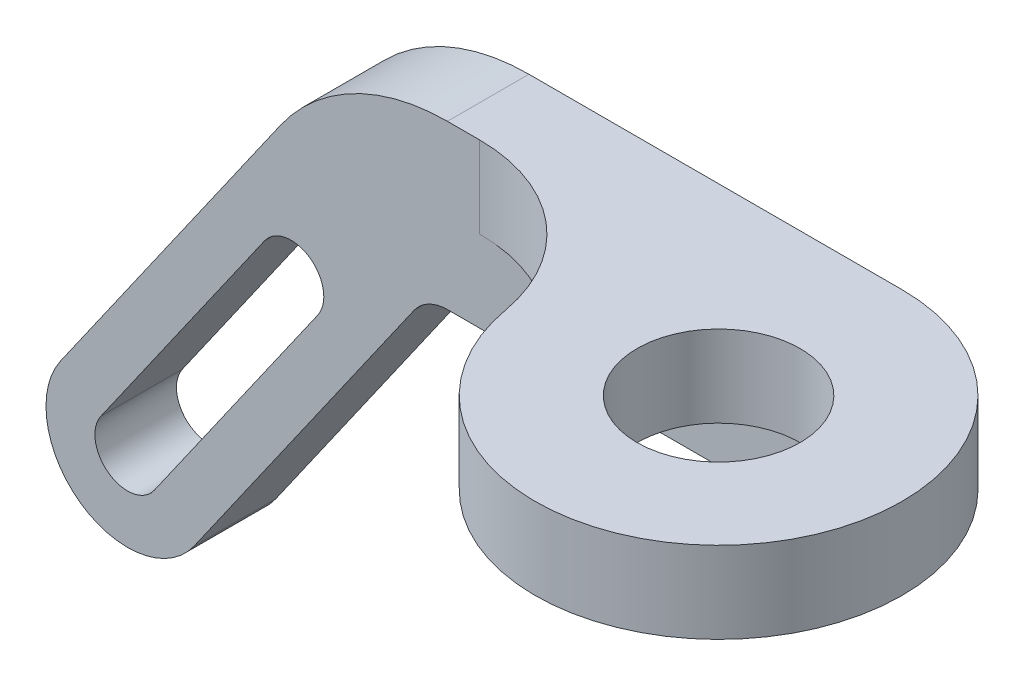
from build123d import *

# Parameters (mm, degrees)
BASE_EXTRUDE_DEPTH  = 10
SKETCH2_R           = 22.5
BOSS_EXTRUDE1_DEPTH = 10
FILLET1_R           = 5
FILLET2_R           = 25
FILLET3_R           = 20
CUT_EXTRUDE1_DEPTH  = 126.672593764
SKETCH4_R           = 10
CUT_EXTRUDE2_DEPTH  = 134.384026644


with BuildPart() as part:
    # Sketch1 → Base-Extrude (new body)
    with BuildSketch(Plane.XY):
        with BuildLine():
            Line((-8.191520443, 5.735764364), (26.223065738, 54.884887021))
            Line((26.223065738, 54.884887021), (85, 54.884887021))
            Line((85, 54.884887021), (85, 34.884887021))
            Line((85, 34.884887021), (36.634406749, 34.884887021))
            Line((36.634406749, 34.884887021), (8.191520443, -5.735764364))
            ThreePointArc((8.191520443, -5.735764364), (-5.735764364, -8.191520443), (-8.191520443, 5.735764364))
        make_face()
    extrude(amount=BASE_EXTRUDE_DEPTH)

    # Sketch2 → Boss-Extrude1 (add)
    with BuildSketch(Plane(origin=(0, 54.884887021, 0), x_dir=(-1, 0, 0), z_dir=(0, 1, 0))):
        with Locations((-85, 22.5)):
            Circle(SKETCH2_R)
    extrude(amount=-BOSS_EXTRUDE1_DEPTH)

    # Fillet1
    fillet1_edges = [part.edges().sort_by_distance(p)[0] for p in [
        (36.634406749, 34.884887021, 5),
    ]]
    fillet(fillet1_edges, radius=FILLET1_R)

    # Fillet2
    fillet2_edges = [part.edges().sort_by_distance(p)[0] for p in [
        (26.223065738, 54.884887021, 5),
    ]]
    fillet(fillet2_edges, radius=FILLET2_R)

    # Fillet3
    fillet3_edges = [part.edges().sort_by_distance(p)[0] for p in [
        (66.291713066, 49.884887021, 10),
    ]]
    fillet(fillet3_edges, radius=FILLET3_R)

    # Sketch3 → Cut-Extrude1 (cut, through all)
    with BuildSketch(Plane.XY.offset(10)):
        with BuildLine():
            Line((-3.276608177, 2.294305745), (16.798567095, 30.964627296))
            ThreePointArc((16.798567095, 30.964627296), (22.369481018, 31.946929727), (23.351783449, 26.376015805))
            Line((23.351783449, 26.376015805), (3.276608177, -2.294305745))
            ThreePointArc((3.276608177, -2.294305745), (-2.294305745, -3.276608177), (-3.276608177, 2.294305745))
        make_face()
    extrude(amount=-CUT_EXTRUDE1_DEPTH, mode=Mode.SUBTRACT)

    # Sketch4 → Cut-Extrude2 (cut, through all)
    with BuildSketch(Plane(origin=(0, 54.884887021, 0), x_dir=(-1, 0, 0), z_dir=(0, 1, 0))):
        with Locations(Location((-85, 22.5, 0), (0, 0, 90))):
            Circle(SKETCH4_R)
    extrude(amount=-CUT_EXTRUDE2_DEPTH, mode=Mode.SUBTRACT)


solid = part.part
